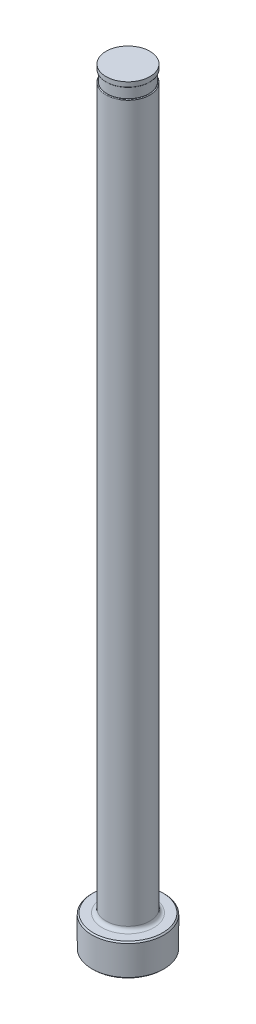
ISO-10303-21;
HEADER;
FILE_DESCRIPTION(('STEP AP214'),'2;1');
FILE_NAME('part.step','',(''),(''),'','','');
FILE_SCHEMA(('AUTOMOTIVE_DESIGN { 1 0 10303 214 1 1 1 1 }'));
ENDSEC;
DATA;
#1=APPLICATION_CONTEXT('core data for automotive mechanical design processes');
#2=APPLICATION_PROTOCOL_DEFINITION('international standard','automotive_design',2000,#1);
#3=PRODUCT_CONTEXT('',#1,'mechanical');
#4=PRODUCT('Part','Part','',(#3));
#5=PRODUCT_RELATED_PRODUCT_CATEGORY('part','',(#4));
#6=PRODUCT_DEFINITION_FORMATION('','',#4);
#7=PRODUCT_DEFINITION_CONTEXT('part definition',#1,'design');
#8=PRODUCT_DEFINITION('design','',#6,#7);
#9=PRODUCT_DEFINITION_SHAPE('','',#8);
#10=(LENGTH_UNIT() NAMED_UNIT(*) SI_UNIT(.MILLI.,.METRE.));
#11=(NAMED_UNIT(*) PLANE_ANGLE_UNIT() SI_UNIT($,.RADIAN.));
#12=(NAMED_UNIT(*) SI_UNIT($,.STERADIAN.) SOLID_ANGLE_UNIT());
#13=UNCERTAINTY_MEASURE_WITH_UNIT(LENGTH_MEASURE(1.E-05),#10,'distance_accuracy_value','');
#14=(GEOMETRIC_REPRESENTATION_CONTEXT(3) GLOBAL_UNCERTAINTY_ASSIGNED_CONTEXT((#13)) GLOBAL_UNIT_ASSIGNED_CONTEXT((#10,
#11,#12)) REPRESENTATION_CONTEXT('',''));
#15=CARTESIAN_POINT('',(0.,0.,0.));
#16=DIRECTION('',(0.,0.,1.));
#17=DIRECTION('',(1.,0.,0.));
#18=AXIS2_PLACEMENT_3D('',#15,#16,#17);
#19=CARTESIAN_POINT('',(-4.36498999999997,151.384,0.));
#20=DIRECTION('',(0.,1.,0.));
#21=DIRECTION('',(0.,0.,1.));
#22=AXIS2_PLACEMENT_3D('',#19,#20,#21);
#23=PLANE('',#22);
#24=CARTESIAN_POINT('',(0.,151.384,0.));
#25=DIRECTION('',(0.,1.,0.));
#26=DIRECTION('',(0.,0.,1.));
#27=AXIS2_PLACEMENT_3D('',#24,#25,#26);
#28=CIRCLE('',#27,4.23290999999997);
#29=CARTESIAN_POINT('',(0.,151.384,4.23290999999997));
#30=VERTEX_POINT('',#29);
#31=EDGE_CURVE('E11',#30,#30,#28,.F.);
#32=ORIENTED_EDGE('',*,*,#31,.T.);
#33=EDGE_LOOP('',(#32));
#34=FACE_BOUND('',#33,.T.);
#35=CARTESIAN_POINT('',(0.,151.384,0.));
#36=DIRECTION('',(0.,1.,0.));
#37=DIRECTION('',(0.,0.,1.));
#38=AXIS2_PLACEMENT_3D('',#35,#36,#37);
#39=CIRCLE('',#38,4.16178999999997);
#40=CARTESIAN_POINT('',(0.,151.384,4.16178999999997));
#41=VERTEX_POINT('',#40);
#42=EDGE_CURVE('E78',#41,#41,#39,.T.);
#43=ORIENTED_EDGE('',*,*,#42,.T.);
#44=EDGE_LOOP('',(#43));
#45=FACE_BOUND('',#44,.T.);
#46=ADVANCED_FACE('F36',(#34,#45),#23,.F.);
#47=CARTESIAN_POINT('',(0.,259.958771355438,0.));
#48=DIRECTION('',(0.,1.,0.));
#49=DIRECTION('',(0.,0.,1.));
#50=AXIS2_PLACEMENT_3D('',#47,#48,#49);
#51=CYLINDRICAL_SURFACE('',#50,4.36498999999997);
#52=DIRECTION('',(0.,1.,0.));
#53=VECTOR('',#52,1.);
#54=CARTESIAN_POINT('',(-4.16178999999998,259.958771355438,-1.31629848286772));
#55=LINE('',#54,#53);
#56=CARTESIAN_POINT('',(-4.16178999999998,149.225,-1.31629848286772));
#57=VERTEX_POINT('',#56);
#58=CARTESIAN_POINT('',(-4.16178999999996,86.868,-1.31629848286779));
#59=VERTEX_POINT('',#58);
#60=EDGE_CURVE('E73',#57,#59,#55,.F.);
#61=ORIENTED_EDGE('',*,*,#60,.F.);
#62=CARTESIAN_POINT('',(0.,149.225,0.));
#63=DIRECTION('',(0.,-1.,0.));
#64=DIRECTION('',(0.,0.,-1.));
#65=AXIS2_PLACEMENT_3D('',#62,#63,#64);
#66=CIRCLE('',#65,4.36498999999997);
#67=CARTESIAN_POINT('',(-4.16178999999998,149.225,1.31629848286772));
#68=VERTEX_POINT('',#67);
#69=EDGE_CURVE('E51',#57,#68,#66,.T.);
#70=ORIENTED_EDGE('',*,*,#69,.T.);
#71=DIRECTION('',(0.,1.,0.));
#72=VECTOR('',#71,1.);
#73=CARTESIAN_POINT('',(-4.16178999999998,259.958771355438,1.31629848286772));
#74=LINE('',#73,#72);
#75=CARTESIAN_POINT('',(-4.16178999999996,86.868,1.31629848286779));
#76=VERTEX_POINT('',#75);
#77=EDGE_CURVE('E84',#76,#68,#74,.T.);
#78=ORIENTED_EDGE('',*,*,#77,.F.);
#79=CARTESIAN_POINT('',(-4.16178999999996,86.868,-1.31629848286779));
#80=CARTESIAN_POINT('',(-4.16178749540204,86.8387945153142,-1.31629969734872));
#81=CARTESIAN_POINT('',(-4.1621934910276,86.8096054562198,-1.31502339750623));
#82=CARTESIAN_POINT('',(-4.16379602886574,86.7514799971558,-1.30994313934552));
#83=CARTESIAN_POINT('',(-4.16499229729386,86.7225435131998,-1.30614005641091));
#84=CARTESIAN_POINT('',(-4.16970978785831,86.6367304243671,-1.29103636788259));
#85=CARTESIAN_POINT('',(-4.1743602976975,86.5805217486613,-1.27604058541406));
#86=CARTESIAN_POINT('',(-4.18613251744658,86.4717895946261,-1.23686822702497));
#87=CARTESIAN_POINT('',(-4.19325232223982,86.4192633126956,-1.21269872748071));
#88=CARTESIAN_POINT('',(-4.2091888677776,86.3190804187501,-1.15616869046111));
#89=CARTESIAN_POINT('',(-4.21800681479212,86.2714273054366,-1.12380232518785));
#90=CARTESIAN_POINT('',(-4.23656898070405,86.1814175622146,-1.05167440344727));
#91=CARTESIAN_POINT('',(-4.24632261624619,86.1391275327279,-1.01183271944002));
#92=CARTESIAN_POINT('',(-4.26580066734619,86.0609847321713,-0.926286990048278));
#93=CARTESIAN_POINT('',(-4.27552507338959,86.0251338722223,-0.880581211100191));
#94=CARTESIAN_POINT('',(-4.29543366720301,85.955720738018,-0.77811045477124));
#95=CARTESIAN_POINT('',(-4.3055056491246,85.923104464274,-0.720683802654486));
#96=CARTESIAN_POINT('',(-4.32376922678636,85.8663921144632,-0.601498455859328));
#97=CARTESIAN_POINT('',(-4.33195978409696,85.8423007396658,-0.539737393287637));
#98=CARTESIAN_POINT('',(-4.34685789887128,85.7995798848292,-0.40406237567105));
#99=CARTESIAN_POINT('',(-4.35317398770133,85.7822625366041,-0.329691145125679));
#100=CARTESIAN_POINT('',(-4.36197215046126,85.7583864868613,-0.179011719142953));
#101=CARTESIAN_POINT('',(-4.3644520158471,85.7518339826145,-0.102702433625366));
#102=CARTESIAN_POINT('',(-4.36541803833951,85.7492580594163,0.0581828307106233));
#103=CARTESIAN_POINT('',(-4.36345629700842,85.7544156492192,0.142783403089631));
#104=CARTESIAN_POINT('',(-4.35477620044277,85.7778747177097,0.309955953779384));
#105=CARTESIAN_POINT('',(-4.34805523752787,85.7961834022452,0.39252679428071));
#106=CARTESIAN_POINT('',(-4.33049146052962,85.8464757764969,0.55371755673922));
#107=CARTESIAN_POINT('',(-4.31961605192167,85.8785678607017,0.632300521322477));
#108=CARTESIAN_POINT('',(-4.29509465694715,85.9567472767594,0.781669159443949));
#109=CARTESIAN_POINT('',(-4.28145345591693,86.0028105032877,0.852467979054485));
#110=CARTESIAN_POINT('',(-4.25707286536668,86.0949515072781,0.965882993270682));
#111=CARTESIAN_POINT('',(-4.24649547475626,86.1379441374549,1.01105227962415));
#112=CARTESIAN_POINT('',(-4.22598230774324,86.2310038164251,1.09362608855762));
#113=CARTESIAN_POINT('',(-4.21604624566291,86.2810676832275,1.13103408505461));
#114=CARTESIAN_POINT('',(-4.19787550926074,86.3876091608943,1.19672699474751));
#115=CARTESIAN_POINT('',(-4.18965172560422,86.4441244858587,1.22495411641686));
#116=CARTESIAN_POINT('',(-4.17605152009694,86.5616762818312,1.27055384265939));
#117=CARTESIAN_POINT('',(-4.17067066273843,86.6227055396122,1.28794336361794));
#118=CARTESIAN_POINT('',(-4.1653318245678,86.7150266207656,1.30505888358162));
#119=CARTESIAN_POINT('',(-4.16400812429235,86.7454684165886,1.30926961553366));
#120=CARTESIAN_POINT('',(-4.16223627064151,86.8066003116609,1.31488836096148));
#121=CARTESIAN_POINT('',(-4.16178714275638,86.8372900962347,1.31629949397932));
#122=CARTESIAN_POINT('',(-4.16178999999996,86.868,1.31629848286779));
#123=B_SPLINE_CURVE_WITH_KNOTS('',3,(#79,#80,#81,#82,#83,#84,#85,#86,#87,#88,#89,#90,#91,#92,
#93,#94,#95,#96,#97,#98,#99,#100,#101,#102,#103,#104,#105,#106,#107,#108,#109,#110,#111,#112,
#113,#114,#115,#116,#117,#118,#119,#120,#121,#122),.UNSPECIFIED.,.F.,.F.,(4,2,2,2,2,2,2,2,2,2,2,
2,2,2,2,2,2,2,2,2,2,4),(0.,0.0875537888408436,0.175077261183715,0.349153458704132,
0.523095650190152,0.697161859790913,0.873213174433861,1.04931665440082,1.24895267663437,
1.44869862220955,1.6776260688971,1.90668526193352,2.15985748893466,2.41316854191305,
2.66850922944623,2.92341184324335,3.11238644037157,3.30127627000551,3.49133308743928,
3.68109249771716,3.77325015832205,3.86530507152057),.UNSPECIFIED.);
#124=EDGE_CURVE('E81',#59,#76,#123,.T.);
#125=ORIENTED_EDGE('',*,*,#124,.F.);
#126=EDGE_LOOP('',(#61,#70,#78,#125));
#127=FACE_BOUND('',#126,.T.);
#128=CARTESIAN_POINT('',(0.,7.11200000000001,0.));
#129=DIRECTION('',(0.,1.,0.));
#130=DIRECTION('',(0.,0.,1.));
#131=AXIS2_PLACEMENT_3D('',#128,#129,#130);
#132=CIRCLE('',#131,4.36498999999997);
#133=CARTESIAN_POINT('',(0.,7.11200000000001,4.36498999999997));
#134=VERTEX_POINT('',#133);
#135=EDGE_CURVE('E116',#134,#134,#132,.T.);
#136=ORIENTED_EDGE('',*,*,#135,.T.);
#137=EDGE_LOOP('',(#136));
#138=FACE_BOUND('',#137,.T.);
#139=ADVANCED_FACE('F82',(#127,#138),#51,.T.);
#140=CARTESIAN_POINT('',(0.,0.,0.));
#141=DIRECTION('',(0.,-1.,0.));
#142=DIRECTION('',(0.,0.,-1.));
#143=AXIS2_PLACEMENT_3D('',#140,#141,#142);
#144=PLANE('',#143);
#145=CARTESIAN_POINT('',(0.,0.,0.));
#146=DIRECTION('',(0.,-1.,0.));
#147=DIRECTION('',(0.,0.,-1.));
#148=AXIS2_PLACEMENT_3D('',#145,#146,#147);
#149=CIRCLE('',#148,6.88339999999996);
#150=CARTESIAN_POINT('',(0.,0.,-6.88339999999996));
#151=VERTEX_POINT('',#150);
#152=EDGE_CURVE('E113',#151,#151,#149,.T.);
#153=ORIENTED_EDGE('',*,*,#152,.T.);
#154=EDGE_LOOP('',(#153));
#155=FACE_BOUND('',#154,.T.);
#156=ADVANCED_FACE('F192',(#155),#144,.T.);
#157=CARTESIAN_POINT('',(0.,259.958771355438,0.));
#158=DIRECTION('',(0.,1.,0.));
#159=DIRECTION('',(0.,0.,1.));
#160=AXIS2_PLACEMENT_3D('',#157,#158,#159);
#161=CYLINDRICAL_SURFACE('',#160,7.13739999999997);
#162=CARTESIAN_POINT('',(0.,6.09599999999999,0.));
#163=DIRECTION('',(0.,1.,0.));
#164=DIRECTION('',(0.,0.,1.));
#165=AXIS2_PLACEMENT_3D('',#162,#163,#164);
#166=CIRCLE('',#165,7.13739999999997);
#167=CARTESIAN_POINT('',(0.,6.09599999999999,7.13739999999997));
#168=VERTEX_POINT('',#167);
#169=EDGE_CURVE('E110',#168,#168,#166,.F.);
#170=ORIENTED_EDGE('',*,*,#169,.T.);
#171=EDGE_LOOP('',(#170));
#172=FACE_BOUND('',#171,.T.);
#173=CARTESIAN_POINT('',(0.,0.254000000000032,0.));
#174=DIRECTION('',(0.,-1.,0.));
#175=DIRECTION('',(0.,0.,-1.));
#176=AXIS2_PLACEMENT_3D('',#173,#174,#175);
#177=CIRCLE('',#176,7.13739999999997);
#178=CARTESIAN_POINT('',(0.,0.254000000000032,-7.13739999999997));
#179=VERTEX_POINT('',#178);
#180=EDGE_CURVE('E107',#179,#179,#177,.F.);
#181=ORIENTED_EDGE('',*,*,#180,.T.);
#182=EDGE_LOOP('',(#181));
#183=FACE_BOUND('',#182,.T.);
#184=ADVANCED_FACE('F195',(#172,#183),#161,.T.);
#185=CARTESIAN_POINT('',(-7.13739999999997,6.35,0.));
#186=DIRECTION('',(0.,1.,0.));
#187=DIRECTION('',(0.,0.,1.));
#188=AXIS2_PLACEMENT_3D('',#185,#186,#187);
#189=PLANE('',#188);
#190=CARTESIAN_POINT('',(0.,6.35,0.));
#191=DIRECTION('',(0.,1.,0.));
#192=DIRECTION('',(0.,0.,1.));
#193=AXIS2_PLACEMENT_3D('',#190,#191,#192);
#194=CIRCLE('',#193,5.12698999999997);
#195=CARTESIAN_POINT('',(0.,6.35,5.12698999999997));
#196=VERTEX_POINT('',#195);
#197=EDGE_CURVE('E87',#196,#196,#194,.F.);
#198=ORIENTED_EDGE('',*,*,#197,.T.);
#199=EDGE_LOOP('',(#198));
#200=FACE_BOUND('',#199,.T.);
#201=CARTESIAN_POINT('',(0.,6.35,0.));
#202=DIRECTION('',(0.,1.,0.));
#203=DIRECTION('',(0.,0.,1.));
#204=AXIS2_PLACEMENT_3D('',#201,#202,#203);
#205=CIRCLE('',#204,6.88340000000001);
#206=CARTESIAN_POINT('',(0.,6.35,6.88340000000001));
#207=VERTEX_POINT('',#206);
#208=EDGE_CURVE('E104',#207,#207,#205,.T.);
#209=ORIENTED_EDGE('',*,*,#208,.T.);
#210=EDGE_LOOP('',(#209));
#211=FACE_BOUND('',#210,.T.);
#212=ADVANCED_FACE('F190',(#200,#211),#189,.T.);
#213=CARTESIAN_POINT('',(0.,6.35000000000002,0.));
#214=DIRECTION('',(0.,-1.,0.));
#215=DIRECTION('',(0.,0.,-1.));
#216=AXIS2_PLACEMENT_3D('',#213,#214,#215);
#217=CONICAL_SURFACE('',#216,6.88339999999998,0.785398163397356);
#218=ORIENTED_EDGE('',*,*,#169,.F.);
#219=EDGE_LOOP('',(#218));
#220=FACE_BOUND('',#219,.T.);
#221=ORIENTED_EDGE('',*,*,#208,.F.);
#222=EDGE_LOOP('',(#221));
#223=FACE_BOUND('',#222,.T.);
#224=ADVANCED_FACE('F186',(#220,#223),#217,.T.);
#225=CARTESIAN_POINT('',(0.,0.254000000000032,0.));
#226=DIRECTION('',(0.,1.,0.));
#227=DIRECTION('',(0.,0.,1.));
#228=AXIS2_PLACEMENT_3D('',#225,#226,#227);
#229=CONICAL_SURFACE('',#228,7.13739999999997,0.785398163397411);
#230=ORIENTED_EDGE('',*,*,#152,.F.);
#231=EDGE_LOOP('',(#230));
#232=FACE_BOUND('',#231,.T.);
#233=ORIENTED_EDGE('',*,*,#180,.F.);
#234=EDGE_LOOP('',(#233));
#235=FACE_BOUND('',#234,.T.);
#236=ADVANCED_FACE('F182',(#232,#235),#229,.T.);
#237=CARTESIAN_POINT('',(0.,7.11200000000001,0.));
#238=DIRECTION('',(0.,1.,0.));
#239=DIRECTION('',(0.,0.,1.));
#240=AXIS2_PLACEMENT_3D('',#237,#238,#239);
#241=TOROIDAL_SURFACE('',#240,5.12698999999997,0.762);
#242=ORIENTED_EDGE('',*,*,#197,.F.);
#243=EDGE_LOOP('',(#242));
#244=FACE_BOUND('',#243,.T.);
#245=ORIENTED_EDGE('',*,*,#135,.F.);
#246=EDGE_LOOP('',(#245));
#247=FACE_BOUND('',#246,.T.);
#248=ADVANCED_FACE('F147',(#244,#247),#241,.F.);
#249=CARTESIAN_POINT('',(-4.36498999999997,149.352,0.));
#250=DIRECTION('',(0.,-1.,0.));
#251=DIRECTION('',(0.,0.,-1.));
#252=AXIS2_PLACEMENT_3D('',#249,#250,#251);
#253=PLANE('',#252);
#254=DIRECTION('',(0.,0.,1.));
#255=VECTOR('',#254,1.);
#256=CARTESIAN_POINT('',(-4.16178999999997,149.352,0.));
#257=LINE('',#256,#255);
#258=CARTESIAN_POINT('',(-4.16178999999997,149.352,0.));
#259=VERTEX_POINT('',#258);
#260=CARTESIAN_POINT('',(-4.16178999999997,149.352,0.800039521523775));
#261=VERTEX_POINT('',#260);
#262=EDGE_CURVE('E90',#259,#261,#257,.T.);
#263=ORIENTED_EDGE('',*,*,#262,.T.);
#264=CARTESIAN_POINT('',(0.,149.352,0.));
#265=DIRECTION('',(0.,-1.,0.));
#266=DIRECTION('',(0.,0.,-1.));
#267=AXIS2_PLACEMENT_3D('',#264,#265,#266);
#268=CIRCLE('',#267,4.23798999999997);
#269=CARTESIAN_POINT('',(-4.16178999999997,149.352,-0.800039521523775));
#270=VERTEX_POINT('',#269);
#271=EDGE_CURVE('E86',#261,#270,#268,.F.);
#272=ORIENTED_EDGE('',*,*,#271,.T.);
#273=EDGE_CURVE('E79',#270,#259,#257,.T.);
#274=ORIENTED_EDGE('',*,*,#273,.T.);
#275=CARTESIAN_POINT('',(0.,149.352,0.));
#276=DIRECTION('',(0.,1.,0.));
#277=DIRECTION('',(0.,0.,1.));
#278=AXIS2_PLACEMENT_3D('',#275,#276,#277);
#279=CIRCLE('',#278,4.16178999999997);
#280=EDGE_CURVE('E101',#259,#259,#279,.T.);
#281=ORIENTED_EDGE('',*,*,#280,.F.);
#282=EDGE_LOOP('',(#263,#272,#274,#281));
#283=FACE_BOUND('',#282,.T.);
#284=ADVANCED_FACE('F144',(#283),#253,.F.);
#285=CARTESIAN_POINT('',(0.,153.448281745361,0.));
#286=DIRECTION('',(0.,1.,0.));
#287=DIRECTION('',(0.,0.,1.));
#288=AXIS2_PLACEMENT_3D('',#285,#286,#287);
#289=CYLINDRICAL_SURFACE('',#288,4.16178999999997);
#290=ORIENTED_EDGE('',*,*,#42,.F.);
#291=EDGE_LOOP('',(#290));
#292=FACE_BOUND('',#291,.T.);
#293=ORIENTED_EDGE('',*,*,#280,.T.);
#294=EDGE_LOOP('',(#293));
#295=FACE_BOUND('',#294,.T.);
#296=ADVANCED_FACE('F141',(#292,#295),#289,.T.);
#297=CARTESIAN_POINT('',(-4.16178999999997,150.368,-7.13739999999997));
#298=DIRECTION('',(1.,0.,0.));
#299=DIRECTION('',(0.,1.,0.));
#300=AXIS2_PLACEMENT_3D('',#297,#298,#299);
#301=PLANE('',#300);
#302=ORIENTED_EDGE('',*,*,#273,.F.);
#303=CARTESIAN_POINT('',(-4.16178999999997,149.352,-0.800039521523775));
#304=CARTESIAN_POINT('',(-4.16178999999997,149.351995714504,-0.82118028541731));
#305=CARTESIAN_POINT('',(-4.16178999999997,149.351811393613,-0.842323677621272));
#306=CARTESIAN_POINT('',(-4.16178999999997,149.350968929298,-0.884617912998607));
#307=CARTESIAN_POINT('',(-4.16178999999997,149.350310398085,-0.90576874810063));
#308=CARTESIAN_POINT('',(-4.16178999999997,149.34840080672,-0.94814725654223));
#309=CARTESIAN_POINT('',(-4.16178999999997,149.34714690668,-0.969374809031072));
#310=CARTESIAN_POINT('',(-4.16178999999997,149.343884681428,-1.01176701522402));
#311=CARTESIAN_POINT('',(-4.16178999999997,149.34187661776,-1.03293168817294));
#312=CARTESIAN_POINT('',(-4.16178999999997,149.337582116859,-1.0691753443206));
#313=CARTESIAN_POINT('',(-4.16178999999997,149.335535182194,-1.08428194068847));
#314=CARTESIAN_POINT('',(-4.16178999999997,149.33080524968,-1.11437533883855));
#315=CARTESIAN_POINT('',(-4.16178999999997,149.328123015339,-1.12936226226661));
#316=CARTESIAN_POINT('',(-4.16178999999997,149.32071784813,-1.1651316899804));
#317=CARTESIAN_POINT('',(-4.16178999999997,149.315607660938,-1.18584256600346));
#318=CARTESIAN_POINT('',(-4.16178999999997,149.305913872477,-1.21666683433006));
#319=CARTESIAN_POINT('',(-4.16178999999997,149.302267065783,-1.22706935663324));
#320=CARTESIAN_POINT('',(-4.16178999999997,149.294021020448,-1.24746733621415));
#321=CARTESIAN_POINT('',(-4.16178999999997,149.289424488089,-1.25746385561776));
#322=CARTESIAN_POINT('',(-4.16178999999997,149.279697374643,-1.27503085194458));
#323=CARTESIAN_POINT('',(-4.16178999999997,149.274799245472,-1.28272062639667));
#324=CARTESIAN_POINT('',(-4.16178999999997,149.266266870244,-1.29339494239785));
#325=CARTESIAN_POINT('',(-4.16178999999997,149.263203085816,-1.2968276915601));
#326=CARTESIAN_POINT('',(-4.16178999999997,149.256576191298,-1.3031775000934));
#327=CARTESIAN_POINT('',(-4.16178999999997,149.253014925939,-1.30609637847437));
#328=CARTESIAN_POINT('',(-4.16178999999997,149.247046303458,-1.30995281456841));
#329=CARTESIAN_POINT('',(-4.16178999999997,149.244835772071,-1.31119247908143));
#330=CARTESIAN_POINT('',(-4.16178999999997,149.240254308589,-1.31331673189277));
#331=CARTESIAN_POINT('',(-4.16178999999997,149.237883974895,-1.31420256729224));
#332=CARTESIAN_POINT('',(-4.16178999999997,149.233757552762,-1.31533351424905));
#333=CARTESIAN_POINT('',(-4.16178999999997,149.232032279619,-1.31569134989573));
#334=CARTESIAN_POINT('',(-4.16178999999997,149.22853901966,-1.31617571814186));
#335=CARTESIAN_POINT('',(-4.16178999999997,149.226770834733,-1.31630080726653));
#336=CARTESIAN_POINT('',(-4.16178999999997,149.225000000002,-1.31629848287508));
#337=B_SPLINE_CURVE_WITH_KNOTS('',3,(#303,#304,#305,#306,#307,#308,#309,#310,#311,#312,#313,
#314,#315,#316,#317,#318,#319,#320,#321,#322,#323,#324,#325,#326,#327,#328,#329,#330,#331,#332,
#333,#334,#335,#336),.UNSPECIFIED.,.F.,.F.,(4,2,2,2,2,2,2,2,2,2,2,2,2,2,2,2,4),(0.,
0.06342555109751,0.126903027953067,0.1906863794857,0.25444763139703,0.300168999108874,
0.345835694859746,0.409709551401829,0.442747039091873,0.475691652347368,0.50289830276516,
0.51666867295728,0.530389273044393,0.537969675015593,0.545523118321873,0.550794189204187,
0.556097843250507),.UNSPECIFIED.);
#338=EDGE_CURVE('E59',#270,#57,#337,.T.);
#339=ORIENTED_EDGE('',*,*,#338,.T.);
#340=ORIENTED_EDGE('',*,*,#60,.T.);
#341=DIRECTION('',(0.,0.,1.));
#342=VECTOR('',#341,1.);
#343=CARTESIAN_POINT('',(-4.16178999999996,86.868,-7.13739999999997));
#344=LINE('',#343,#342);
#345=EDGE_CURVE('E77',#59,#76,#344,.T.);
#346=ORIENTED_EDGE('',*,*,#345,.T.);
#347=ORIENTED_EDGE('',*,*,#77,.T.);
#348=CARTESIAN_POINT('',(-4.16178999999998,149.225,1.31629848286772));
#349=CARTESIAN_POINT('',(-4.16178999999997,149.227523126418,1.31630667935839));
#350=CARTESIAN_POINT('',(-4.16178999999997,149.230034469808,1.31604955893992));
#351=CARTESIAN_POINT('',(-4.16178999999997,149.234933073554,1.31508340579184));
#352=CARTESIAN_POINT('',(-4.16178999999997,149.237321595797,1.31438089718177));
#353=CARTESIAN_POINT('',(-4.16178999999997,149.242507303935,1.31238416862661));
#354=CARTESIAN_POINT('',(-4.16178999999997,149.245264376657,1.31098819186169));
#355=CARTESIAN_POINT('',(-4.16178999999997,149.250531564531,1.30777210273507));
#356=CARTESIAN_POINT('',(-4.16178999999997,149.253040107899,1.30594950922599));
#357=CARTESIAN_POINT('',(-4.16178999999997,149.25952418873,1.30060082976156));
#358=CARTESIAN_POINT('',(-4.16178999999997,149.263261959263,1.29679030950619));
#359=CARTESIAN_POINT('',(-4.16178999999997,149.270164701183,1.28869316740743));
#360=CARTESIAN_POINT('',(-4.16178999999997,149.273328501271,1.28440560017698));
#361=CARTESIAN_POINT('',(-4.16178999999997,149.284792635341,1.26723154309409));
#362=CARTESIAN_POINT('',(-4.16178999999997,149.291556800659,1.25334498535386));
#363=CARTESIAN_POINT('',(-4.16178999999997,149.303249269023,1.22482528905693));
#364=CARTESIAN_POINT('',(-4.16178999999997,149.308164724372,1.21018770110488));
#365=CARTESIAN_POINT('',(-4.16178999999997,149.320246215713,1.16868418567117));
#366=CARTESIAN_POINT('',(-4.16178999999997,149.326057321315,1.14142260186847));
#367=CARTESIAN_POINT('',(-4.16178999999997,149.335470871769,1.08650877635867));
#368=CARTESIAN_POINT('',(-4.16178999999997,149.339067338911,1.05885568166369));
#369=CARTESIAN_POINT('',(-4.16178999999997,149.344732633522,1.00338718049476));
#370=CARTESIAN_POINT('',(-4.16178999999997,149.346801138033,0.975571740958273));
#371=CARTESIAN_POINT('',(-4.16178999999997,149.349839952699,0.919916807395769));
#372=CARTESIAN_POINT('',(-4.16178999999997,149.350811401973,0.892077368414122));
#373=CARTESIAN_POINT('',(-4.16178999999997,149.351591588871,0.853520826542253));
#374=CARTESIAN_POINT('',(-4.16178999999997,149.351747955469,0.842809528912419));
#375=CARTESIAN_POINT('',(-4.16178999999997,149.351951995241,0.821412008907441));
#376=CARTESIAN_POINT('',(-4.16178999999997,149.351999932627,0.810725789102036));
#377=CARTESIAN_POINT('',(-4.16178999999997,149.352,0.800039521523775));
#378=B_SPLINE_CURVE_WITH_KNOTS('',3,(#348,#349,#350,#351,#352,#353,#354,#355,#356,#357,#358,
#359,#360,#361,#362,#363,#364,#365,#366,#367,#368,#369,#370,#371,#372,#373,#374,#375,#376,#377),
.UNSPECIFIED.,.F.,.F.,(4,2,2,2,2,2,2,2,2,2,2,2,2,2,4),(0.,0.00753740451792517,
0.0149668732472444,0.024185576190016,0.0334592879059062,0.0493821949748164,0.0653372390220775,
0.111313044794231,0.157602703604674,0.241002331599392,0.324626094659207,0.408267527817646,
0.49182203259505,0.523958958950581,0.556017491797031),.UNSPECIFIED.);
#379=EDGE_CURVE('E172',#68,#261,#378,.T.);
#380=ORIENTED_EDGE('',*,*,#379,.T.);
#381=ORIENTED_EDGE('',*,*,#262,.F.);
#382=EDGE_LOOP('',(#302,#339,#340,#346,#347,#380,#381));
#383=FACE_BOUND('',#382,.T.);
#384=ADVANCED_FACE('F75',(#383),#301,.F.);
#385=CARTESIAN_POINT('',(-7.33678999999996,86.868,-7.13739999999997));
#386=DIRECTION('',(0.,0.,1.));
#387=DIRECTION('',(1.,0.,0.));
#388=AXIS2_PLACEMENT_3D('',#385,#386,#387);
#389=CYLINDRICAL_SURFACE('',#388,3.175);
#390=ORIENTED_EDGE('',*,*,#345,.F.);
#391=ORIENTED_EDGE('',*,*,#124,.T.);
#392=EDGE_LOOP('',(#390,#391));
#393=FACE_BOUND('',#392,.T.);
#394=ADVANCED_FACE('F89',(#393),#389,.F.);
#395=CARTESIAN_POINT('',(0.,152.687735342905,0.));
#396=DIRECTION('',(0.,1.,0.));
#397=DIRECTION('',(0.,0.,1.));
#398=AXIS2_PLACEMENT_3D('',#395,#396,#397);
#399=CYLINDRICAL_SURFACE('',#398,4.35990999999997);
#400=CARTESIAN_POINT('',(0.,151.511,0.));
#401=DIRECTION('',(0.,1.,0.));
#402=DIRECTION('',(0.,0.,1.));
#403=AXIS2_PLACEMENT_3D('',#400,#401,#402);
#404=CIRCLE('',#403,4.35990999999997);
#405=CARTESIAN_POINT('',(0.,151.511,4.35990999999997));
#406=VERTEX_POINT('',#405);
#407=EDGE_CURVE('E44',#406,#406,#404,.T.);
#408=ORIENTED_EDGE('',*,*,#407,.T.);
#409=EDGE_LOOP('',(#408));
#410=FACE_BOUND('',#409,.T.);
#411=CARTESIAN_POINT('',(0.,152.4,0.));
#412=DIRECTION('',(0.,1.,0.));
#413=DIRECTION('',(0.,0.,1.));
#414=AXIS2_PLACEMENT_3D('',#411,#412,#413);
#415=CIRCLE('',#414,4.35990999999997);
#416=CARTESIAN_POINT('',(0.,152.4,4.35990999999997));
#417=VERTEX_POINT('',#416);
#418=EDGE_CURVE('E91',#417,#417,#415,.T.);
#419=ORIENTED_EDGE('',*,*,#418,.F.);
#420=EDGE_LOOP('',(#419));
#421=FACE_BOUND('',#420,.T.);
#422=ADVANCED_FACE('F135',(#410,#421),#399,.T.);
#423=CARTESIAN_POINT('',(-4.36498999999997,152.4,0.));
#424=DIRECTION('',(0.,1.,0.));
#425=DIRECTION('',(0.,0.,1.));
#426=AXIS2_PLACEMENT_3D('',#423,#424,#425);
#427=PLANE('',#426);
#428=ORIENTED_EDGE('',*,*,#418,.T.);
#429=EDGE_LOOP('',(#428));
#430=FACE_BOUND('',#429,.T.);
#431=ADVANCED_FACE('F149',(#430),#427,.T.);
#432=CARTESIAN_POINT('',(0.,149.225,0.));
#433=DIRECTION('',(0.,-1.,0.));
#434=DIRECTION('',(0.,0.,-1.));
#435=AXIS2_PLACEMENT_3D('',#432,#433,#434);
#436=TOROIDAL_SURFACE('',#435,4.23798999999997,0.127);
#437=ORIENTED_EDGE('',*,*,#379,.F.);
#438=ORIENTED_EDGE('',*,*,#69,.F.);
#439=ORIENTED_EDGE('',*,*,#338,.F.);
#440=ORIENTED_EDGE('',*,*,#271,.F.);
#441=EDGE_LOOP('',(#437,#438,#439,#440));
#442=FACE_BOUND('',#441,.T.);
#443=ADVANCED_FACE('F151',(#442),#436,.T.);
#444=CARTESIAN_POINT('',(0.,151.511,0.));
#445=DIRECTION('',(0.,1.,0.));
#446=DIRECTION('',(0.,0.,1.));
#447=AXIS2_PLACEMENT_3D('',#444,#445,#446);
#448=TOROIDAL_SURFACE('',#447,4.23290999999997,0.127);
#449=ORIENTED_EDGE('',*,*,#31,.F.);
#450=EDGE_LOOP('',(#449));
#451=FACE_BOUND('',#450,.T.);
#452=ORIENTED_EDGE('',*,*,#407,.F.);
#453=EDGE_LOOP('',(#452));
#454=FACE_BOUND('',#453,.T.);
#455=ADVANCED_FACE('F38',(#451,#454),#448,.T.);
#456=CLOSED_SHELL('',(#46,#139,#156,#184,#212,#224,#236,#248,#284,#296,#384,#394,#422,#431,#443,#455));
#457=MANIFOLD_SOLID_BREP('B2',#456);
#458=ADVANCED_BREP_SHAPE_REPRESENTATION('',(#18,#457),#14);
#459=SHAPE_DEFINITION_REPRESENTATION(#9,#458);
ENDSEC;
END-ISO-10303-21;
